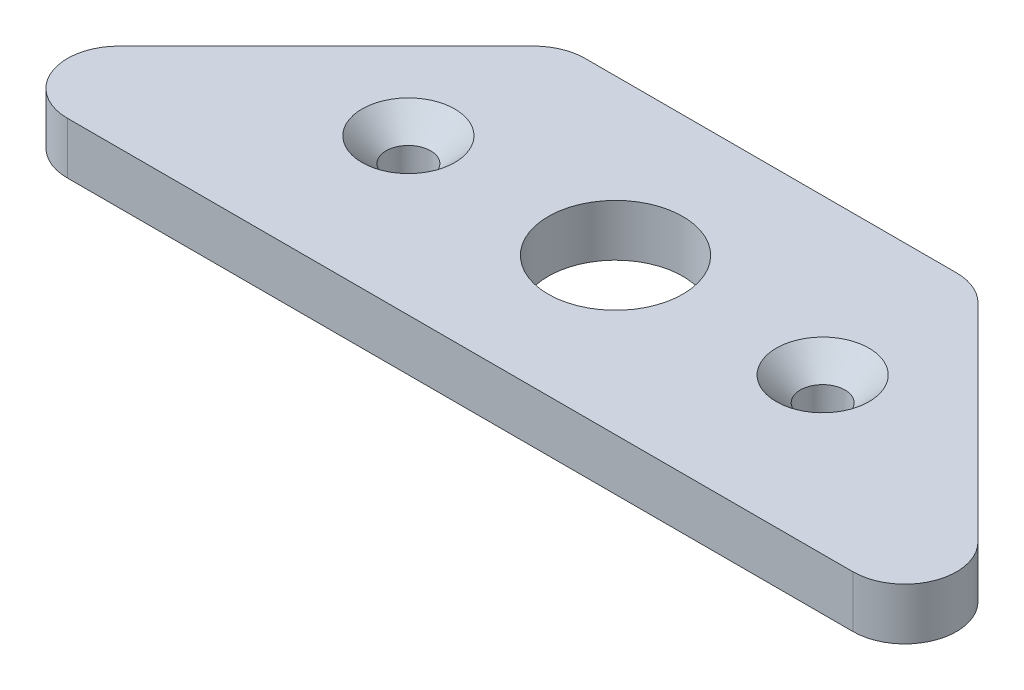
from build123d import *

# Parameters (mm, degrees)
SKETCH1_R                     = 6.5
BOSS_EXTRUDE1_DEPTH           = 5
FILLET1_R                     = 5
CSK_FOR_M4_SFHCS1_D           = 4.3
CSK_FOR_M4_SFHCS1_DEPTH       = 11.5
CSK_FOR_M4_SFHCS1_CSINK_D     = 8.96
CSK_FOR_M4_SFHCS1_CSINK_ANGLE = 90
CSK_FOR_M4_SFHCS1_TIP         = 1.291850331


with BuildPart() as part:
    # Sketch1 → Boss-Extrude1 (new body)
    with BuildSketch(Plane(origin=(0, 0, 0), x_dir=(1, 0, 0), z_dir=(0, 1, 0))):
        Polygon((-10, -15), (-50, -15), (-20, 15), (20, 15), (50, -15), (10, -15), align=None)
        with Locations(Location((0, 0, 0), (0, 0, 270))):
            Circle(SKETCH1_R, mode=Mode.SUBTRACT)
    extrude(amount=BOSS_EXTRUDE1_DEPTH)

    # Fillet1
    fillet1_edges = [part.edges().sort_by_distance(p)[0] for p in [
        (-50, 2.5, 15),
        (-20, 2.5, -15),
        (20, 2.5, -15),
        (50, 2.5, 15),
    ]]
    fillet(fillet1_edges, radius=FILLET1_R)

    # CSK for M4 SFHCS1
    with Locations(Plane(origin=(0, 5, 0), x_dir=(1, 0, 0), z_dir=(0, 1, 0))):
        with Locations((-20, 0), (20, 0)):
            CounterSinkHole(CSK_FOR_M4_SFHCS1_D / 2, CSK_FOR_M4_SFHCS1_CSINK_D / 2, depth=CSK_FOR_M4_SFHCS1_DEPTH, counter_sink_angle=CSK_FOR_M4_SFHCS1_CSINK_ANGLE)
            with Locations((0, 0, -(CSK_FOR_M4_SFHCS1_DEPTH + CSK_FOR_M4_SFHCS1_TIP / 2))):  # 118° drill point
                Cone(0, CSK_FOR_M4_SFHCS1_D / 2, CSK_FOR_M4_SFHCS1_TIP, mode=Mode.SUBTRACT)


solid = part.part
